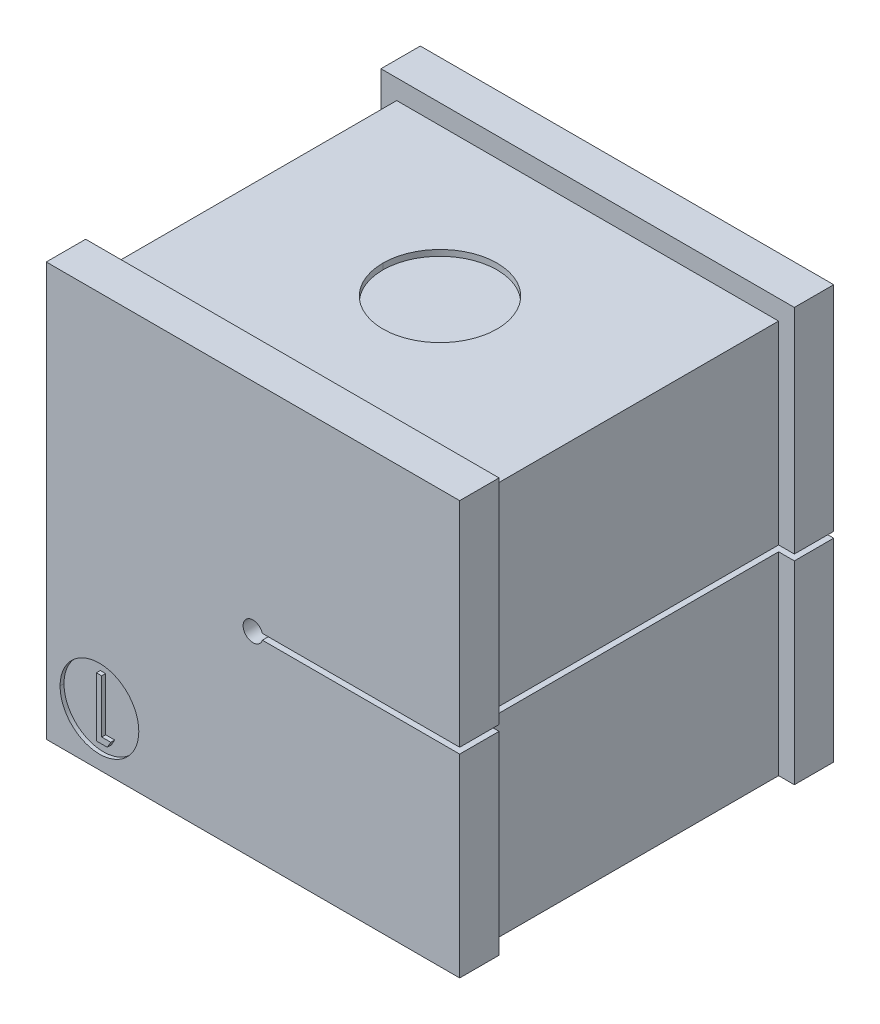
ISO-10303-21;
HEADER;
FILE_DESCRIPTION(('STEP AP214'),'2;1');
FILE_NAME('part.step','',(''),(''),'','','');
FILE_SCHEMA(('AUTOMOTIVE_DESIGN { 1 0 10303 214 1 1 1 1 }'));
ENDSEC;
DATA;
#1=APPLICATION_CONTEXT('core data for automotive mechanical design processes');
#2=APPLICATION_PROTOCOL_DEFINITION('international standard','automotive_design',2000,#1);
#3=PRODUCT_CONTEXT('',#1,'mechanical');
#4=PRODUCT('Part','Part','',(#3));
#5=PRODUCT_RELATED_PRODUCT_CATEGORY('part','',(#4));
#6=PRODUCT_DEFINITION_FORMATION('','',#4);
#7=PRODUCT_DEFINITION_CONTEXT('part definition',#1,'design');
#8=PRODUCT_DEFINITION('design','',#6,#7);
#9=PRODUCT_DEFINITION_SHAPE('','',#8);
#10=(LENGTH_UNIT() NAMED_UNIT(*) SI_UNIT(.MILLI.,.METRE.));
#11=(NAMED_UNIT(*) PLANE_ANGLE_UNIT() SI_UNIT($,.RADIAN.));
#12=(NAMED_UNIT(*) SI_UNIT($,.STERADIAN.) SOLID_ANGLE_UNIT());
#13=UNCERTAINTY_MEASURE_WITH_UNIT(LENGTH_MEASURE(1.E-05),#10,'distance_accuracy_value','');
#14=(GEOMETRIC_REPRESENTATION_CONTEXT(3) GLOBAL_UNCERTAINTY_ASSIGNED_CONTEXT((#13)) GLOBAL_UNIT_ASSIGNED_CONTEXT((#10,
#11,#12)) REPRESENTATION_CONTEXT('',''));
#15=CARTESIAN_POINT('',(0.,0.,0.));
#16=DIRECTION('',(0.,0.,1.));
#17=DIRECTION('',(1.,0.,0.));
#18=AXIS2_PLACEMENT_3D('',#15,#16,#17);
#19=CARTESIAN_POINT('',(0.,0.,9.5));
#20=DIRECTION('',(0.,0.,-1.));
#21=DIRECTION('',(0.,-1.,0.));
#22=AXIS2_PLACEMENT_3D('',#19,#20,#21);
#23=PLANE('',#22);
#24=DIRECTION('',(-0.496686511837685,-0.867930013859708,0.));
#25=VECTOR('',#24,1.);
#26=CARTESIAN_POINT('',(3.27692307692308,-8.99230769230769,9.5));
#27=LINE('',#26,#25);
#28=CARTESIAN_POINT('',(3.27692307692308,-8.99230769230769,9.5));
#29=VERTEX_POINT('',#28);
#30=CARTESIAN_POINT('',(3.10084134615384,-9.3,9.5));
#31=VERTEX_POINT('',#30);
#32=EDGE_CURVE('E585',#29,#31,#27,.T.);
#33=ORIENTED_EDGE('',*,*,#32,.F.);
#34=DIRECTION('',(1.,0.,0.));
#35=VECTOR('',#34,1.);
#36=CARTESIAN_POINT('',(2.81538461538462,-8.99230769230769,9.5));
#37=LINE('',#36,#35);
#38=CARTESIAN_POINT('',(2.81538461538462,-8.99230769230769,9.5));
#39=VERTEX_POINT('',#38);
#40=EDGE_CURVE('E536',#39,#29,#37,.T.);
#41=ORIENTED_EDGE('',*,*,#40,.F.);
#42=DIRECTION('',(0.,-1.,0.));
#43=VECTOR('',#42,1.);
#44=CARTESIAN_POINT('',(2.81538461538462,-6.3,9.5));
#45=LINE('',#44,#43);
#46=CARTESIAN_POINT('',(2.81538461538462,-6.3,9.5));
#47=VERTEX_POINT('',#46);
#48=EDGE_CURVE('E593',#47,#39,#45,.T.);
#49=ORIENTED_EDGE('',*,*,#48,.F.);
#50=DIRECTION('',(1.,0.,0.));
#51=VECTOR('',#50,1.);
#52=CARTESIAN_POINT('',(2.54615384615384,-6.3,9.5));
#53=LINE('',#52,#51);
#54=CARTESIAN_POINT('',(2.54615384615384,-6.3,9.5));
#55=VERTEX_POINT('',#54);
#56=EDGE_CURVE('E19',#55,#47,#53,.T.);
#57=ORIENTED_EDGE('',*,*,#56,.F.);
#58=DIRECTION('',(0.,1.,0.));
#59=VECTOR('',#58,1.);
#60=CARTESIAN_POINT('',(2.54615384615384,-9.3,9.5));
#61=LINE('',#60,#59);
#62=CARTESIAN_POINT('',(2.54615384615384,-9.3,9.5));
#63=VERTEX_POINT('',#62);
#64=EDGE_CURVE('E25',#63,#55,#61,.T.);
#65=ORIENTED_EDGE('',*,*,#64,.F.);
#66=DIRECTION('',(-1.,0.,0.));
#67=VECTOR('',#66,1.);
#68=CARTESIAN_POINT('',(3.10084134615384,-9.3,9.5));
#69=LINE('',#68,#67);
#70=EDGE_CURVE('E9',#31,#63,#69,.T.);
#71=ORIENTED_EDGE('',*,*,#70,.F.);
#72=EDGE_LOOP('',(#33,#41,#49,#57,#65,#71));
#73=FACE_BOUND('',#72,.T.);
#74=ADVANCED_FACE('F15',(#73),#23,.F.);
#75=CARTESIAN_POINT('',(3.10084134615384,-9.3,9.5));
#76=DIRECTION('',(0.,-1.,0.));
#77=DIRECTION('',(0.,0.,-1.));
#78=AXIS2_PLACEMENT_3D('',#75,#76,#77);
#79=PLANE('',#78);
#80=DIRECTION('',(-1.,0.,0.));
#81=VECTOR('',#80,1.);
#82=CARTESIAN_POINT('',(3.10084134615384,-9.3,9.3));
#83=LINE('',#82,#81);
#84=CARTESIAN_POINT('',(3.10084134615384,-9.3,9.3));
#85=VERTEX_POINT('',#84);
#86=CARTESIAN_POINT('',(2.54615384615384,-9.3,9.3));
#87=VERTEX_POINT('',#86);
#88=EDGE_CURVE('E440',#85,#87,#83,.T.);
#89=ORIENTED_EDGE('',*,*,#88,.F.);
#90=DIRECTION('',(0.,0.,-1.));
#91=VECTOR('',#90,1.);
#92=CARTESIAN_POINT('',(3.10084134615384,-9.3,9.5));
#93=LINE('',#92,#91);
#94=EDGE_CURVE('E537',#31,#85,#93,.T.);
#95=ORIENTED_EDGE('',*,*,#94,.F.);
#96=ORIENTED_EDGE('',*,*,#70,.T.);
#97=DIRECTION('',(0.,0.,-1.));
#98=VECTOR('',#97,1.);
#99=CARTESIAN_POINT('',(2.54615384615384,-9.3,9.5));
#100=LINE('',#99,#98);
#101=EDGE_CURVE('E349',#63,#87,#100,.T.);
#102=ORIENTED_EDGE('',*,*,#101,.T.);
#103=EDGE_LOOP('',(#89,#95,#96,#102));
#104=FACE_BOUND('',#103,.T.);
#105=ADVANCED_FACE('F616',(#104),#79,.T.);
#106=CARTESIAN_POINT('',(2.54615384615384,-9.3,9.5));
#107=DIRECTION('',(-1.,0.,0.));
#108=DIRECTION('',(0.,0.,1.));
#109=AXIS2_PLACEMENT_3D('',#106,#107,#108);
#110=PLANE('',#109);
#111=DIRECTION('',(0.,1.,0.));
#112=VECTOR('',#111,1.);
#113=CARTESIAN_POINT('',(2.54615384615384,-9.3,9.3));
#114=LINE('',#113,#112);
#115=CARTESIAN_POINT('',(2.54615384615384,-6.3,9.3));
#116=VERTEX_POINT('',#115);
#117=EDGE_CURVE('E444',#87,#116,#114,.T.);
#118=ORIENTED_EDGE('',*,*,#117,.F.);
#119=ORIENTED_EDGE('',*,*,#101,.F.);
#120=ORIENTED_EDGE('',*,*,#64,.T.);
#121=DIRECTION('',(0.,0.,-1.));
#122=VECTOR('',#121,1.);
#123=CARTESIAN_POINT('',(2.54615384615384,-6.3,9.5));
#124=LINE('',#123,#122);
#125=EDGE_CURVE('E595',#55,#116,#124,.T.);
#126=ORIENTED_EDGE('',*,*,#125,.T.);
#127=EDGE_LOOP('',(#118,#119,#120,#126));
#128=FACE_BOUND('',#127,.T.);
#129=ADVANCED_FACE('F17',(#128),#110,.T.);
#130=CARTESIAN_POINT('',(2.54615384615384,-6.3,9.5));
#131=DIRECTION('',(0.,1.,0.));
#132=DIRECTION('',(1.,0.,0.));
#133=AXIS2_PLACEMENT_3D('',#130,#131,#132);
#134=PLANE('',#133);
#135=DIRECTION('',(1.,0.,0.));
#136=VECTOR('',#135,1.);
#137=CARTESIAN_POINT('',(2.54615384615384,-6.3,9.3));
#138=LINE('',#137,#136);
#139=CARTESIAN_POINT('',(2.81538461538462,-6.3,9.3));
#140=VERTEX_POINT('',#139);
#141=EDGE_CURVE('E576',#116,#140,#138,.T.);
#142=ORIENTED_EDGE('',*,*,#141,.F.);
#143=ORIENTED_EDGE('',*,*,#125,.F.);
#144=ORIENTED_EDGE('',*,*,#56,.T.);
#145=DIRECTION('',(0.,0.,-1.));
#146=VECTOR('',#145,1.);
#147=CARTESIAN_POINT('',(2.81538461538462,-6.3,9.5));
#148=LINE('',#147,#146);
#149=EDGE_CURVE('E544',#47,#140,#148,.T.);
#150=ORIENTED_EDGE('',*,*,#149,.T.);
#151=EDGE_LOOP('',(#142,#143,#144,#150));
#152=FACE_BOUND('',#151,.T.);
#153=ADVANCED_FACE('F604',(#152),#134,.T.);
#154=CARTESIAN_POINT('',(2.81538461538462,-6.3,9.5));
#155=DIRECTION('',(1.,0.,0.));
#156=DIRECTION('',(0.,1.,0.));
#157=AXIS2_PLACEMENT_3D('',#154,#155,#156);
#158=PLANE('',#157);
#159=DIRECTION('',(0.,-1.,0.));
#160=VECTOR('',#159,1.);
#161=CARTESIAN_POINT('',(2.81538461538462,-6.3,9.3));
#162=LINE('',#161,#160);
#163=CARTESIAN_POINT('',(2.81538461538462,-8.99230769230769,9.3));
#164=VERTEX_POINT('',#163);
#165=EDGE_CURVE('E514',#140,#164,#162,.T.);
#166=ORIENTED_EDGE('',*,*,#165,.F.);
#167=ORIENTED_EDGE('',*,*,#149,.F.);
#168=ORIENTED_EDGE('',*,*,#48,.T.);
#169=DIRECTION('',(0.,0.,-1.));
#170=VECTOR('',#169,1.);
#171=CARTESIAN_POINT('',(2.81538461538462,-8.99230769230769,9.5));
#172=LINE('',#171,#170);
#173=EDGE_CURVE('E533',#39,#164,#172,.T.);
#174=ORIENTED_EDGE('',*,*,#173,.T.);
#175=EDGE_LOOP('',(#166,#167,#168,#174));
#176=FACE_BOUND('',#175,.T.);
#177=ADVANCED_FACE('F612',(#176),#158,.T.);
#178=CARTESIAN_POINT('',(2.81538461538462,-8.99230769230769,9.5));
#179=DIRECTION('',(0.,1.,0.));
#180=DIRECTION('',(1.,0.,0.));
#181=AXIS2_PLACEMENT_3D('',#178,#179,#180);
#182=PLANE('',#181);
#183=DIRECTION('',(1.,0.,0.));
#184=VECTOR('',#183,1.);
#185=CARTESIAN_POINT('',(2.81538461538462,-8.99230769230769,9.3));
#186=LINE('',#185,#184);
#187=CARTESIAN_POINT('',(3.27692307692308,-8.99230769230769,9.3));
#188=VERTEX_POINT('',#187);
#189=EDGE_CURVE('E509',#164,#188,#186,.T.);
#190=ORIENTED_EDGE('',*,*,#189,.F.);
#191=ORIENTED_EDGE('',*,*,#173,.F.);
#192=ORIENTED_EDGE('',*,*,#40,.T.);
#193=DIRECTION('',(0.,0.,-1.));
#194=VECTOR('',#193,1.);
#195=CARTESIAN_POINT('',(3.27692307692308,-8.99230769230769,9.5));
#196=LINE('',#195,#194);
#197=EDGE_CURVE('E513',#29,#188,#196,.T.);
#198=ORIENTED_EDGE('',*,*,#197,.T.);
#199=EDGE_LOOP('',(#190,#191,#192,#198));
#200=FACE_BOUND('',#199,.T.);
#201=ADVANCED_FACE('F622',(#200),#182,.T.);
#202=CARTESIAN_POINT('',(3.27692307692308,-8.99230769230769,9.5));
#203=DIRECTION('',(0.867930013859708,-0.496686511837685,0.));
#204=DIRECTION('',(0.,0.,-1.));
#205=AXIS2_PLACEMENT_3D('',#202,#203,#204);
#206=PLANE('',#205);
#207=DIRECTION('',(-0.496686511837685,-0.867930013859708,0.));
#208=VECTOR('',#207,1.);
#209=CARTESIAN_POINT('',(3.27692307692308,-8.99230769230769,9.3));
#210=LINE('',#209,#208);
#211=EDGE_CURVE('E281',#188,#85,#210,.T.);
#212=ORIENTED_EDGE('',*,*,#211,.F.);
#213=ORIENTED_EDGE('',*,*,#197,.F.);
#214=ORIENTED_EDGE('',*,*,#32,.T.);
#215=ORIENTED_EDGE('',*,*,#94,.T.);
#216=EDGE_LOOP('',(#212,#213,#214,#215));
#217=FACE_BOUND('',#216,.T.);
#218=ADVANCED_FACE('F620',(#217),#206,.T.);
#219=CARTESIAN_POINT('',(10.5,-0.5,-10.9142135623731));
#220=DIRECTION('',(0.,0.,1.));
#221=DIRECTION('',(1.,0.,0.));
#222=AXIS2_PLACEMENT_3D('',#219,#220,#221);
#223=CYLINDRICAL_SURFACE('',#222,0.5);
#224=DIRECTION('',(0.,0.,1.));
#225=VECTOR('',#224,1.);
#226=CARTESIAN_POINT('',(10.9769696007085,-0.35,-10.9142135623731));
#227=LINE('',#226,#225);
#228=CARTESIAN_POINT('',(10.9769696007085,-0.35,-9.5));
#229=VERTEX_POINT('',#228);
#230=CARTESIAN_POINT('',(10.9769696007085,-0.35,9.5));
#231=VERTEX_POINT('',#230);
#232=EDGE_CURVE('E393',#229,#231,#227,.T.);
#233=ORIENTED_EDGE('',*,*,#232,.T.);
#234=CARTESIAN_POINT('',(10.5,-0.5,9.5));
#235=DIRECTION('',(0.,0.,1.));
#236=DIRECTION('',(1.,0.,0.));
#237=AXIS2_PLACEMENT_3D('',#234,#235,#236);
#238=CIRCLE('',#237,0.5);
#239=CARTESIAN_POINT('',(10.9769696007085,-0.65,9.5));
#240=VERTEX_POINT('',#239);
#241=EDGE_CURVE('E478',#231,#240,#238,.T.);
#242=ORIENTED_EDGE('',*,*,#241,.T.);
#243=DIRECTION('',(0.,0.,-1.));
#244=VECTOR('',#243,1.);
#245=CARTESIAN_POINT('',(10.9769696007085,-0.65,-10.9142135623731));
#246=LINE('',#245,#244);
#247=CARTESIAN_POINT('',(10.9769696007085,-0.65,-9.5));
#248=VERTEX_POINT('',#247);
#249=EDGE_CURVE('E320',#240,#248,#246,.T.);
#250=ORIENTED_EDGE('',*,*,#249,.T.);
#251=CARTESIAN_POINT('',(10.5,-0.5,-9.5));
#252=DIRECTION('',(0.,0.,1.));
#253=DIRECTION('',(-1.,0.,0.));
#254=AXIS2_PLACEMENT_3D('',#251,#252,#253);
#255=CIRCLE('',#254,0.5);
#256=EDGE_CURVE('E477',#229,#248,#255,.T.);
#257=ORIENTED_EDGE('',*,*,#256,.F.);
#258=EDGE_LOOP('',(#233,#242,#250,#257));
#259=FACE_BOUND('',#258,.T.);
#260=ADVANCED_FACE('F630',(#259),#223,.F.);
#261=CARTESIAN_POINT('',(2.7,-7.8,9.3));
#262=DIRECTION('',(0.,0.,1.));
#263=DIRECTION('',(1.,0.,0.));
#264=AXIS2_PLACEMENT_3D('',#261,#262,#263);
#265=PLANE('',#264);
#266=ORIENTED_EDGE('',*,*,#211,.T.);
#267=ORIENTED_EDGE('',*,*,#88,.T.);
#268=ORIENTED_EDGE('',*,*,#117,.T.);
#269=ORIENTED_EDGE('',*,*,#141,.T.);
#270=ORIENTED_EDGE('',*,*,#165,.T.);
#271=ORIENTED_EDGE('',*,*,#189,.T.);
#272=EDGE_LOOP('',(#266,#267,#268,#269,#270,#271));
#273=FACE_BOUND('',#272,.T.);
#274=CARTESIAN_POINT('',(2.7,-7.8,9.3));
#275=DIRECTION('',(0.,0.,1.));
#276=DIRECTION('',(1.,0.,0.));
#277=AXIS2_PLACEMENT_3D('',#274,#275,#276);
#278=CIRCLE('',#277,2.);
#279=CARTESIAN_POINT('',(4.7,-7.8,9.3));
#280=VERTEX_POINT('',#279);
#281=CARTESIAN_POINT('',(0.7,-7.8,9.3));
#282=VERTEX_POINT('',#281);
#283=EDGE_CURVE('E272',#280,#282,#278,.T.);
#284=ORIENTED_EDGE('',*,*,#283,.T.);
#285=CARTESIAN_POINT('',(2.7,-7.8,9.3));
#286=DIRECTION('',(0.,0.,1.));
#287=DIRECTION('',(1.,0.,0.));
#288=AXIS2_PLACEMENT_3D('',#285,#286,#287);
#289=CIRCLE('',#288,2.);
#290=EDGE_CURVE('E276',#282,#280,#289,.T.);
#291=ORIENTED_EDGE('',*,*,#290,.T.);
#292=EDGE_LOOP('',(#284,#291));
#293=FACE_BOUND('',#292,.T.);
#294=ADVANCED_FACE('F274',(#273,#293),#265,.T.);
#295=CARTESIAN_POINT('',(2.7,-7.8,9.3));
#296=DIRECTION('',(0.,0.,1.));
#297=DIRECTION('',(1.,0.,0.));
#298=AXIS2_PLACEMENT_3D('',#295,#296,#297);
#299=CYLINDRICAL_SURFACE('',#298,2.);
#300=DIRECTION('',(0.,0.,1.));
#301=VECTOR('',#300,1.);
#302=CARTESIAN_POINT('',(0.7,-7.8,9.3));
#303=LINE('',#302,#301);
#304=CARTESIAN_POINT('',(0.7,-7.8,9.5));
#305=VERTEX_POINT('',#304);
#306=EDGE_CURVE('E285',#282,#305,#303,.T.);
#307=ORIENTED_EDGE('',*,*,#306,.F.);
#308=ORIENTED_EDGE('',*,*,#283,.F.);
#309=DIRECTION('',(0.,0.,1.));
#310=VECTOR('',#309,1.);
#311=CARTESIAN_POINT('',(4.7,-7.8,9.3));
#312=LINE('',#311,#310);
#313=CARTESIAN_POINT('',(4.7,-7.8,9.5));
#314=VERTEX_POINT('',#313);
#315=EDGE_CURVE('E295',#280,#314,#312,.T.);
#316=ORIENTED_EDGE('',*,*,#315,.T.);
#317=CARTESIAN_POINT('',(2.7,-7.8,9.5));
#318=DIRECTION('',(0.,0.,1.));
#319=DIRECTION('',(1.,0.,0.));
#320=AXIS2_PLACEMENT_3D('',#317,#318,#319);
#321=CIRCLE('',#320,2.);
#322=EDGE_CURVE('E287',#314,#305,#321,.T.);
#323=ORIENTED_EDGE('',*,*,#322,.T.);
#324=EDGE_LOOP('',(#307,#308,#316,#323));
#325=FACE_BOUND('',#324,.T.);
#326=ADVANCED_FACE('F286',(#325),#299,.F.);
#327=CARTESIAN_POINT('',(10.5,9.2,0.));
#328=DIRECTION('',(0.,1.,0.));
#329=DIRECTION('',(-1.,0.,0.));
#330=AXIS2_PLACEMENT_3D('',#327,#328,#329);
#331=CYLINDRICAL_SURFACE('',#330,2.9);
#332=DIRECTION('',(0.,1.,0.));
#333=VECTOR('',#332,1.);
#334=CARTESIAN_POINT('',(13.4,9.2,0.));
#335=LINE('',#334,#333);
#336=CARTESIAN_POINT('',(13.4,9.2,0.));
#337=VERTEX_POINT('',#336);
#338=CARTESIAN_POINT('',(13.4,9.5,0.));
#339=VERTEX_POINT('',#338);
#340=EDGE_CURVE('E355',#337,#339,#335,.T.);
#341=ORIENTED_EDGE('',*,*,#340,.F.);
#342=CARTESIAN_POINT('',(10.5,9.2,0.));
#343=DIRECTION('',(0.,1.,0.));
#344=DIRECTION('',(-1.,0.,0.));
#345=AXIS2_PLACEMENT_3D('',#342,#343,#344);
#346=CIRCLE('',#345,2.9);
#347=CARTESIAN_POINT('',(7.6,9.2,0.));
#348=VERTEX_POINT('',#347);
#349=EDGE_CURVE('E282',#348,#337,#346,.T.);
#350=ORIENTED_EDGE('',*,*,#349,.F.);
#351=DIRECTION('',(0.,1.,0.));
#352=VECTOR('',#351,1.);
#353=CARTESIAN_POINT('',(7.6,9.2,0.));
#354=LINE('',#353,#352);
#355=CARTESIAN_POINT('',(7.6,9.5,0.));
#356=VERTEX_POINT('',#355);
#357=EDGE_CURVE('E373',#348,#356,#354,.T.);
#358=ORIENTED_EDGE('',*,*,#357,.T.);
#359=CARTESIAN_POINT('',(10.5,9.5,0.));
#360=DIRECTION('',(0.,-1.,0.));
#361=DIRECTION('',(1.,0.,0.));
#362=AXIS2_PLACEMENT_3D('',#359,#360,#361);
#363=CIRCLE('',#362,2.9);
#364=EDGE_CURVE('E490',#339,#356,#363,.T.);
#365=ORIENTED_EDGE('',*,*,#364,.F.);
#366=EDGE_LOOP('',(#341,#350,#358,#365));
#367=FACE_BOUND('',#366,.T.);
#368=ADVANCED_FACE('F680',(#367),#331,.F.);
#369=CARTESIAN_POINT('',(10.5,9.2,0.));
#370=DIRECTION('',(0.,1.,0.));
#371=DIRECTION('',(1.,0.,0.));
#372=AXIS2_PLACEMENT_3D('',#369,#370,#371);
#373=PLANE('',#372);
#374=ORIENTED_EDGE('',*,*,#349,.T.);
#375=CARTESIAN_POINT('',(10.5,9.2,0.));
#376=DIRECTION('',(0.,1.,0.));
#377=DIRECTION('',(-1.,0.,0.));
#378=AXIS2_PLACEMENT_3D('',#375,#376,#377);
#379=CIRCLE('',#378,2.9);
#380=EDGE_CURVE('E348',#337,#348,#379,.T.);
#381=ORIENTED_EDGE('',*,*,#380,.T.);
#382=EDGE_LOOP('',(#374,#381));
#383=FACE_BOUND('',#382,.T.);
#384=ADVANCED_FACE('F726',(#383),#373,.T.);
#385=CARTESIAN_POINT('',(1.3,0.,7.5));
#386=DIRECTION('',(0.,0.,1.));
#387=DIRECTION('',(1.,0.,0.));
#388=AXIS2_PLACEMENT_3D('',#385,#386,#387);
#389=PLANE('',#388);
#390=DIRECTION('',(0.,-1.,0.));
#391=VECTOR('',#390,1.);
#392=CARTESIAN_POINT('',(20.2,9.5,7.5));
#393=LINE('',#392,#391);
#394=CARTESIAN_POINT('',(20.2,-0.65,7.5));
#395=VERTEX_POINT('',#394);
#396=CARTESIAN_POINT('',(20.2,-10.5,7.5));
#397=VERTEX_POINT('',#396);
#398=EDGE_CURVE('E508',#395,#397,#393,.T.);
#399=ORIENTED_EDGE('',*,*,#398,.F.);
#400=DIRECTION('',(1.,0.,0.));
#401=VECTOR('',#400,1.);
#402=CARTESIAN_POINT('',(1.3,-0.65,7.5));
#403=LINE('',#402,#401);
#404=CARTESIAN_POINT('',(21.,-0.65,7.5));
#405=VERTEX_POINT('',#404);
#406=EDGE_CURVE('E300',#395,#405,#403,.T.);
#407=ORIENTED_EDGE('',*,*,#406,.T.);
#408=DIRECTION('',(0.,1.,0.));
#409=VECTOR('',#408,1.);
#410=CARTESIAN_POINT('',(21.,-10.5,7.5));
#411=LINE('',#410,#409);
#412=CARTESIAN_POINT('',(21.,-10.5,7.5));
#413=VERTEX_POINT('',#412);
#414=EDGE_CURVE('E307',#413,#405,#411,.T.);
#415=ORIENTED_EDGE('',*,*,#414,.F.);
#416=DIRECTION('',(-1.,0.,0.));
#417=VECTOR('',#416,1.);
#418=CARTESIAN_POINT('',(19.7,-10.5,7.5));
#419=LINE('',#418,#417);
#420=EDGE_CURVE('E449',#413,#397,#419,.T.);
#421=ORIENTED_EDGE('',*,*,#420,.T.);
#422=EDGE_LOOP('',(#399,#407,#415,#421));
#423=FACE_BOUND('',#422,.T.);
#424=ADVANCED_FACE('F722',(#423),#389,.F.);
#425=CARTESIAN_POINT('',(0.,0.,-7.5));
#426=DIRECTION('',(0.,0.,-1.));
#427=DIRECTION('',(-1.,0.,0.));
#428=AXIS2_PLACEMENT_3D('',#425,#426,#427);
#429=PLANE('',#428);
#430=DIRECTION('',(0.,1.,0.));
#431=VECTOR('',#430,1.);
#432=CARTESIAN_POINT('',(21.,-10.5,-7.5));
#433=LINE('',#432,#431);
#434=CARTESIAN_POINT('',(21.,-10.5,-7.5));
#435=VERTEX_POINT('',#434);
#436=CARTESIAN_POINT('',(21.,-0.65,-7.5));
#437=VERTEX_POINT('',#436);
#438=EDGE_CURVE('E328',#435,#437,#433,.T.);
#439=ORIENTED_EDGE('',*,*,#438,.T.);
#440=DIRECTION('',(-1.,0.,0.));
#441=VECTOR('',#440,1.);
#442=CARTESIAN_POINT('',(0.,-0.65,-7.5));
#443=LINE('',#442,#441);
#444=CARTESIAN_POINT('',(20.2,-0.65,-7.5));
#445=VERTEX_POINT('',#444);
#446=EDGE_CURVE('E313',#437,#445,#443,.T.);
#447=ORIENTED_EDGE('',*,*,#446,.T.);
#448=DIRECTION('',(0.,1.,0.));
#449=VECTOR('',#448,1.);
#450=CARTESIAN_POINT('',(20.2,9.5,-7.5));
#451=LINE('',#450,#449);
#452=CARTESIAN_POINT('',(20.2,-10.5,-7.5));
#453=VERTEX_POINT('',#452);
#454=EDGE_CURVE('E522',#453,#445,#451,.T.);
#455=ORIENTED_EDGE('',*,*,#454,.F.);
#456=DIRECTION('',(1.,0.,0.));
#457=VECTOR('',#456,1.);
#458=CARTESIAN_POINT('',(21.,-10.5,-7.5));
#459=LINE('',#458,#457);
#460=EDGE_CURVE('E453',#453,#435,#459,.T.);
#461=ORIENTED_EDGE('',*,*,#460,.T.);
#462=EDGE_LOOP('',(#439,#447,#455,#461));
#463=FACE_BOUND('',#462,.T.);
#464=ADVANCED_FACE('F718',(#463),#429,.F.);
#465=CARTESIAN_POINT('',(0.,0.,-9.5));
#466=DIRECTION('',(0.,0.,-1.));
#467=DIRECTION('',(0.,-1.,0.));
#468=AXIS2_PLACEMENT_3D('',#465,#466,#467);
#469=PLANE('',#468);
#470=DIRECTION('',(-1.,0.,0.));
#471=VECTOR('',#470,1.);
#472=CARTESIAN_POINT('',(10.0230303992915,-0.35,-9.5));
#473=LINE('',#472,#471);
#474=CARTESIAN_POINT('',(21.,-0.35,-9.5));
#475=VERTEX_POINT('',#474);
#476=EDGE_CURVE('E397',#475,#229,#473,.T.);
#477=ORIENTED_EDGE('',*,*,#476,.T.);
#478=ORIENTED_EDGE('',*,*,#256,.T.);
#479=DIRECTION('',(1.,0.,0.));
#480=VECTOR('',#479,1.);
#481=CARTESIAN_POINT('',(10.0230303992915,-0.65,-9.5));
#482=LINE('',#481,#480);
#483=CARTESIAN_POINT('',(21.,-0.65,-9.5));
#484=VERTEX_POINT('',#483);
#485=EDGE_CURVE('E325',#248,#484,#482,.T.);
#486=ORIENTED_EDGE('',*,*,#485,.T.);
#487=DIRECTION('',(0.,-1.,0.));
#488=VECTOR('',#487,1.);
#489=CARTESIAN_POINT('',(21.,0.,-9.5));
#490=LINE('',#489,#488);
#491=CARTESIAN_POINT('',(21.,-10.5,-9.5));
#492=VERTEX_POINT('',#491);
#493=EDGE_CURVE('E308',#484,#492,#490,.T.);
#494=ORIENTED_EDGE('',*,*,#493,.T.);
#495=DIRECTION('',(-1.,0.,0.));
#496=VECTOR('',#495,1.);
#497=CARTESIAN_POINT('',(0.,-10.5,-9.5));
#498=LINE('',#497,#496);
#499=CARTESIAN_POINT('',(0.,-10.5,-9.5));
#500=VERTEX_POINT('',#499);
#501=EDGE_CURVE('E532',#492,#500,#498,.T.);
#502=ORIENTED_EDGE('',*,*,#501,.T.);
#503=DIRECTION('',(0.,-1.,0.));
#504=VECTOR('',#503,1.);
#505=CARTESIAN_POINT('',(0.,0.,-9.5));
#506=LINE('',#505,#504);
#507=CARTESIAN_POINT('',(0.,10.5,-9.5));
#508=VERTEX_POINT('',#507);
#509=EDGE_CURVE('E345',#508,#500,#506,.T.);
#510=ORIENTED_EDGE('',*,*,#509,.F.);
#511=DIRECTION('',(-1.,0.,0.));
#512=VECTOR('',#511,1.);
#513=CARTESIAN_POINT('',(0.,10.5,-9.5));
#514=LINE('',#513,#512);
#515=CARTESIAN_POINT('',(21.,10.5,-9.5));
#516=VERTEX_POINT('',#515);
#517=EDGE_CURVE('E500',#516,#508,#514,.T.);
#518=ORIENTED_EDGE('',*,*,#517,.F.);
#519=DIRECTION('',(0.,-1.,0.));
#520=VECTOR('',#519,1.);
#521=CARTESIAN_POINT('',(21.,0.,-9.5));
#522=LINE('',#521,#520);
#523=EDGE_CURVE('E432',#516,#475,#522,.T.);
#524=ORIENTED_EDGE('',*,*,#523,.T.);
#525=EDGE_LOOP('',(#477,#478,#486,#494,#502,#510,#518,#524));
#526=FACE_BOUND('',#525,.T.);
#527=ADVANCED_FACE('F714',(#526),#469,.T.);
#528=CARTESIAN_POINT('',(0.,0.,9.5));
#529=DIRECTION('',(0.,0.,-1.));
#530=DIRECTION('',(0.,-1.,0.));
#531=AXIS2_PLACEMENT_3D('',#528,#529,#530);
#532=PLANE('',#531);
#533=ORIENTED_EDGE('',*,*,#322,.F.);
#534=CARTESIAN_POINT('',(2.7,-7.8,9.5));
#535=DIRECTION('',(0.,0.,1.));
#536=DIRECTION('',(1.,0.,0.));
#537=AXIS2_PLACEMENT_3D('',#534,#535,#536);
#538=CIRCLE('',#537,2.);
#539=EDGE_CURVE('E292',#305,#314,#538,.T.);
#540=ORIENTED_EDGE('',*,*,#539,.F.);
#541=EDGE_LOOP('',(#533,#540));
#542=FACE_BOUND('',#541,.T.);
#543=ORIENTED_EDGE('',*,*,#241,.F.);
#544=DIRECTION('',(-1.,0.,0.));
#545=VECTOR('',#544,1.);
#546=CARTESIAN_POINT('',(10.0230303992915,-0.35,9.5));
#547=LINE('',#546,#545);
#548=CARTESIAN_POINT('',(21.,-0.35,9.5));
#549=VERTEX_POINT('',#548);
#550=EDGE_CURVE('E386',#549,#231,#547,.T.);
#551=ORIENTED_EDGE('',*,*,#550,.F.);
#552=DIRECTION('',(0.,-1.,0.));
#553=VECTOR('',#552,1.);
#554=CARTESIAN_POINT('',(21.,0.,9.5));
#555=LINE('',#554,#553);
#556=CARTESIAN_POINT('',(21.,10.5,9.5));
#557=VERTEX_POINT('',#556);
#558=EDGE_CURVE('E465',#557,#549,#555,.T.);
#559=ORIENTED_EDGE('',*,*,#558,.F.);
#560=DIRECTION('',(-1.,0.,0.));
#561=VECTOR('',#560,1.);
#562=CARTESIAN_POINT('',(0.,10.5,9.5));
#563=LINE('',#562,#561);
#564=CARTESIAN_POINT('',(0.,10.5,9.5));
#565=VERTEX_POINT('',#564);
#566=EDGE_CURVE('E496',#557,#565,#563,.T.);
#567=ORIENTED_EDGE('',*,*,#566,.T.);
#568=DIRECTION('',(0.,-1.,0.));
#569=VECTOR('',#568,1.);
#570=CARTESIAN_POINT('',(0.,0.,9.5));
#571=LINE('',#570,#569);
#572=CARTESIAN_POINT('',(0.,-10.5,9.5));
#573=VERTEX_POINT('',#572);
#574=EDGE_CURVE('E342',#565,#573,#571,.T.);
#575=ORIENTED_EDGE('',*,*,#574,.T.);
#576=DIRECTION('',(-1.,0.,0.));
#577=VECTOR('',#576,1.);
#578=CARTESIAN_POINT('',(0.,-10.5,9.5));
#579=LINE('',#578,#577);
#580=CARTESIAN_POINT('',(21.,-10.5,9.5));
#581=VERTEX_POINT('',#580);
#582=EDGE_CURVE('E554',#581,#573,#579,.T.);
#583=ORIENTED_EDGE('',*,*,#582,.F.);
#584=DIRECTION('',(0.,-1.,0.));
#585=VECTOR('',#584,1.);
#586=CARTESIAN_POINT('',(21.,0.,9.5));
#587=LINE('',#586,#585);
#588=CARTESIAN_POINT('',(21.,-0.65,9.5));
#589=VERTEX_POINT('',#588);
#590=EDGE_CURVE('E305',#589,#581,#587,.T.);
#591=ORIENTED_EDGE('',*,*,#590,.F.);
#592=DIRECTION('',(1.,0.,0.));
#593=VECTOR('',#592,1.);
#594=CARTESIAN_POINT('',(10.0230303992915,-0.65,9.5));
#595=LINE('',#594,#593);
#596=EDGE_CURVE('E324',#240,#589,#595,.T.);
#597=ORIENTED_EDGE('',*,*,#596,.F.);
#598=EDGE_LOOP('',(#543,#551,#559,#567,#575,#583,#591,#597));
#599=FACE_BOUND('',#598,.T.);
#600=ADVANCED_FACE('F710',(#542,#599),#532,.F.);
#601=CARTESIAN_POINT('',(0.8,0.,1.75));
#602=DIRECTION('',(1.,0.,0.));
#603=DIRECTION('',(0.,0.,-1.));
#604=AXIS2_PLACEMENT_3D('',#601,#602,#603);
#605=PLANE('',#604);
#606=DIRECTION('',(0.,0.,-1.));
#607=VECTOR('',#606,1.);
#608=CARTESIAN_POINT('',(0.8,-10.5,1.75));
#609=LINE('',#608,#607);
#610=CARTESIAN_POINT('',(0.8,-10.5,7.5));
#611=VERTEX_POINT('',#610);
#612=CARTESIAN_POINT('',(0.8,-10.5,-7.5));
#613=VERTEX_POINT('',#612);
#614=EDGE_CURVE('E525',#611,#613,#609,.T.);
#615=ORIENTED_EDGE('',*,*,#614,.F.);
#616=DIRECTION('',(0.,1.,0.));
#617=VECTOR('',#616,1.);
#618=CARTESIAN_POINT('',(0.8,9.5,7.5));
#619=LINE('',#618,#617);
#620=CARTESIAN_POINT('',(0.8,9.5,7.5));
#621=VERTEX_POINT('',#620);
#622=EDGE_CURVE('E481',#611,#621,#619,.T.);
#623=ORIENTED_EDGE('',*,*,#622,.T.);
#624=DIRECTION('',(0.,0.,-1.));
#625=VECTOR('',#624,1.);
#626=CARTESIAN_POINT('',(0.8,9.5,1.75));
#627=LINE('',#626,#625);
#628=CARTESIAN_POINT('',(0.8,9.5,-7.5));
#629=VERTEX_POINT('',#628);
#630=EDGE_CURVE('E338',#621,#629,#627,.T.);
#631=ORIENTED_EDGE('',*,*,#630,.T.);
#632=DIRECTION('',(0.,-1.,0.));
#633=VECTOR('',#632,1.);
#634=CARTESIAN_POINT('',(0.8,9.5,-7.5));
#635=LINE('',#634,#633);
#636=EDGE_CURVE('E360',#629,#613,#635,.T.);
#637=ORIENTED_EDGE('',*,*,#636,.T.);
#638=EDGE_LOOP('',(#615,#623,#631,#637));
#639=FACE_BOUND('',#638,.T.);
#640=ADVANCED_FACE('F706',(#639),#605,.F.);
#641=CARTESIAN_POINT('',(0.,0.,9.5));
#642=DIRECTION('',(1.,0.,0.));
#643=DIRECTION('',(0.,1.,0.));
#644=AXIS2_PLACEMENT_3D('',#641,#642,#643);
#645=PLANE('',#644);
#646=DIRECTION('',(0.,0.,-1.));
#647=VECTOR('',#646,1.);
#648=CARTESIAN_POINT('',(0.,-10.5,9.5));
#649=LINE('',#648,#647);
#650=CARTESIAN_POINT('',(0.,-10.5,-7.5));
#651=VERTEX_POINT('',#650);
#652=EDGE_CURVE('E528',#651,#500,#649,.T.);
#653=ORIENTED_EDGE('',*,*,#652,.F.);
#654=DIRECTION('',(0.,1.,0.));
#655=VECTOR('',#654,1.);
#656=CARTESIAN_POINT('',(0.,0.,-7.5));
#657=LINE('',#656,#655);
#658=CARTESIAN_POINT('',(0.,10.5,-7.5));
#659=VERTEX_POINT('',#658);
#660=EDGE_CURVE('E361',#651,#659,#657,.T.);
#661=ORIENTED_EDGE('',*,*,#660,.T.);
#662=DIRECTION('',(0.,0.,-1.));
#663=VECTOR('',#662,1.);
#664=CARTESIAN_POINT('',(0.,10.5,9.5));
#665=LINE('',#664,#663);
#666=EDGE_CURVE('E504',#659,#508,#665,.T.);
#667=ORIENTED_EDGE('',*,*,#666,.T.);
#668=ORIENTED_EDGE('',*,*,#509,.T.);
#669=EDGE_LOOP('',(#653,#661,#667,#668));
#670=FACE_BOUND('',#669,.T.);
#671=ADVANCED_FACE('F702',(#670),#645,.F.);
#672=CARTESIAN_POINT('',(0.,0.,9.5));
#673=DIRECTION('',(1.,0.,0.));
#674=DIRECTION('',(0.,1.,0.));
#675=AXIS2_PLACEMENT_3D('',#672,#673,#674);
#676=PLANE('',#675);
#677=DIRECTION('',(0.,1.,0.));
#678=VECTOR('',#677,1.);
#679=CARTESIAN_POINT('',(0.,0.,7.5));
#680=LINE('',#679,#678);
#681=CARTESIAN_POINT('',(0.,-10.5,7.5));
#682=VERTEX_POINT('',#681);
#683=CARTESIAN_POINT('',(0.,10.5,7.5));
#684=VERTEX_POINT('',#683);
#685=EDGE_CURVE('E314',#682,#684,#680,.T.);
#686=ORIENTED_EDGE('',*,*,#685,.F.);
#687=DIRECTION('',(0.,0.,-1.));
#688=VECTOR('',#687,1.);
#689=CARTESIAN_POINT('',(0.,-10.5,9.5));
#690=LINE('',#689,#688);
#691=EDGE_CURVE('E331',#573,#682,#690,.T.);
#692=ORIENTED_EDGE('',*,*,#691,.F.);
#693=ORIENTED_EDGE('',*,*,#574,.F.);
#694=DIRECTION('',(0.,0.,-1.));
#695=VECTOR('',#694,1.);
#696=CARTESIAN_POINT('',(0.,10.5,9.5));
#697=LINE('',#696,#695);
#698=EDGE_CURVE('E493',#565,#684,#697,.T.);
#699=ORIENTED_EDGE('',*,*,#698,.T.);
#700=EDGE_LOOP('',(#686,#692,#693,#699));
#701=FACE_BOUND('',#700,.T.);
#702=ADVANCED_FACE('F698',(#701),#676,.F.);
#703=CARTESIAN_POINT('',(21.,0.,9.5));
#704=DIRECTION('',(1.,0.,0.));
#705=DIRECTION('',(0.,1.,0.));
#706=AXIS2_PLACEMENT_3D('',#703,#704,#705);
#707=PLANE('',#706);
#708=DIRECTION('',(0.,0.,1.));
#709=VECTOR('',#708,1.);
#710=CARTESIAN_POINT('',(21.,-0.65,-9.5));
#711=LINE('',#710,#709);
#712=EDGE_CURVE('E303',#405,#589,#711,.T.);
#713=ORIENTED_EDGE('',*,*,#712,.T.);
#714=ORIENTED_EDGE('',*,*,#590,.T.);
#715=DIRECTION('',(0.,0.,-1.));
#716=VECTOR('',#715,1.);
#717=CARTESIAN_POINT('',(21.,-10.5,9.5));
#718=LINE('',#717,#716);
#719=EDGE_CURVE('E452',#581,#413,#718,.T.);
#720=ORIENTED_EDGE('',*,*,#719,.T.);
#721=ORIENTED_EDGE('',*,*,#414,.T.);
#722=EDGE_LOOP('',(#713,#714,#720,#721));
#723=FACE_BOUND('',#722,.T.);
#724=ADVANCED_FACE('F691',(#723),#707,.T.);
#725=CARTESIAN_POINT('',(21.,0.,9.5));
#726=DIRECTION('',(1.,0.,0.));
#727=DIRECTION('',(0.,1.,0.));
#728=AXIS2_PLACEMENT_3D('',#725,#726,#727);
#729=PLANE('',#728);
#730=DIRECTION('',(0.,0.,1.));
#731=VECTOR('',#730,1.);
#732=CARTESIAN_POINT('',(21.,-0.65,-9.5));
#733=LINE('',#732,#731);
#734=EDGE_CURVE('E335',#484,#437,#733,.T.);
#735=ORIENTED_EDGE('',*,*,#734,.T.);
#736=ORIENTED_EDGE('',*,*,#438,.F.);
#737=DIRECTION('',(0.,0.,-1.));
#738=VECTOR('',#737,1.);
#739=CARTESIAN_POINT('',(21.,-10.5,9.5));
#740=LINE('',#739,#738);
#741=EDGE_CURVE('E541',#435,#492,#740,.T.);
#742=ORIENTED_EDGE('',*,*,#741,.T.);
#743=ORIENTED_EDGE('',*,*,#493,.F.);
#744=EDGE_LOOP('',(#735,#736,#742,#743));
#745=FACE_BOUND('',#744,.T.);
#746=ADVANCED_FACE('F687',(#745),#729,.T.);
#747=CARTESIAN_POINT('',(0.,-10.5,9.5));
#748=DIRECTION('',(0.,-1.,0.));
#749=DIRECTION('',(0.,0.,-1.));
#750=AXIS2_PLACEMENT_3D('',#747,#748,#749);
#751=PLANE('',#750);
#752=ORIENTED_EDGE('',*,*,#614,.T.);
#753=DIRECTION('',(-1.,0.,0.));
#754=VECTOR('',#753,1.);
#755=CARTESIAN_POINT('',(0.,-10.5,-7.5));
#756=LINE('',#755,#754);
#757=EDGE_CURVE('E356',#613,#651,#756,.T.);
#758=ORIENTED_EDGE('',*,*,#757,.T.);
#759=ORIENTED_EDGE('',*,*,#652,.T.);
#760=ORIENTED_EDGE('',*,*,#501,.F.);
#761=ORIENTED_EDGE('',*,*,#741,.F.);
#762=ORIENTED_EDGE('',*,*,#460,.F.);
#763=DIRECTION('',(0.,0.,-1.));
#764=VECTOR('',#763,1.);
#765=CARTESIAN_POINT('',(20.2,-10.5,1.75));
#766=LINE('',#765,#764);
#767=EDGE_CURVE('E518',#397,#453,#766,.T.);
#768=ORIENTED_EDGE('',*,*,#767,.F.);
#769=ORIENTED_EDGE('',*,*,#420,.F.);
#770=ORIENTED_EDGE('',*,*,#719,.F.);
#771=ORIENTED_EDGE('',*,*,#582,.T.);
#772=ORIENTED_EDGE('',*,*,#691,.T.);
#773=DIRECTION('',(1.,0.,0.));
#774=VECTOR('',#773,1.);
#775=CARTESIAN_POINT('',(1.3,-10.5,7.5));
#776=LINE('',#775,#774);
#777=EDGE_CURVE('E319',#682,#611,#776,.T.);
#778=ORIENTED_EDGE('',*,*,#777,.T.);
#779=EDGE_LOOP('',(#752,#758,#759,#760,#761,#762,#768,#769,#770,#771,#772,#778));
#780=FACE_BOUND('',#779,.T.);
#781=ADVANCED_FACE('F690',(#780),#751,.T.);
#782=CARTESIAN_POINT('',(20.2,-10.5,-5.5));
#783=DIRECTION('',(1.,0.,0.));
#784=DIRECTION('',(0.,1.,0.));
#785=AXIS2_PLACEMENT_3D('',#782,#783,#784);
#786=PLANE('',#785);
#787=DIRECTION('',(0.,0.,-1.));
#788=VECTOR('',#787,1.);
#789=CARTESIAN_POINT('',(20.2,-0.65,-5.5));
#790=LINE('',#789,#788);
#791=EDGE_CURVE('E302',#395,#445,#790,.T.);
#792=ORIENTED_EDGE('',*,*,#791,.F.);
#793=ORIENTED_EDGE('',*,*,#398,.T.);
#794=ORIENTED_EDGE('',*,*,#767,.T.);
#795=ORIENTED_EDGE('',*,*,#454,.T.);
#796=EDGE_LOOP('',(#792,#793,#794,#795));
#797=FACE_BOUND('',#796,.T.);
#798=ADVANCED_FACE('F652',(#797),#786,.T.);
#799=CARTESIAN_POINT('',(0.,10.5,9.5));
#800=DIRECTION('',(0.,-1.,0.));
#801=DIRECTION('',(0.,0.,-1.));
#802=AXIS2_PLACEMENT_3D('',#799,#800,#801);
#803=PLANE('',#802);
#804=DIRECTION('',(-1.,0.,0.));
#805=VECTOR('',#804,1.);
#806=CARTESIAN_POINT('',(0.,10.5,-7.5));
#807=LINE('',#806,#805);
#808=CARTESIAN_POINT('',(21.,10.5,-7.5));
#809=VERTEX_POINT('',#808);
#810=EDGE_CURVE('E468',#809,#659,#807,.T.);
#811=ORIENTED_EDGE('',*,*,#810,.F.);
#812=DIRECTION('',(0.,0.,-1.));
#813=VECTOR('',#812,1.);
#814=CARTESIAN_POINT('',(21.,10.5,9.5));
#815=LINE('',#814,#813);
#816=EDGE_CURVE('E435',#809,#516,#815,.T.);
#817=ORIENTED_EDGE('',*,*,#816,.T.);
#818=ORIENTED_EDGE('',*,*,#517,.T.);
#819=ORIENTED_EDGE('',*,*,#666,.F.);
#820=EDGE_LOOP('',(#811,#817,#818,#819));
#821=FACE_BOUND('',#820,.T.);
#822=ADVANCED_FACE('F648',(#821),#803,.F.);
#823=CARTESIAN_POINT('',(0.,10.5,9.5));
#824=DIRECTION('',(0.,-1.,0.));
#825=DIRECTION('',(0.,0.,-1.));
#826=AXIS2_PLACEMENT_3D('',#823,#824,#825);
#827=PLANE('',#826);
#828=DIRECTION('',(0.,0.,-1.));
#829=VECTOR('',#828,1.);
#830=CARTESIAN_POINT('',(21.,10.5,9.5));
#831=LINE('',#830,#829);
#832=CARTESIAN_POINT('',(21.,10.5,7.5));
#833=VERTEX_POINT('',#832);
#834=EDGE_CURVE('E457',#557,#833,#831,.T.);
#835=ORIENTED_EDGE('',*,*,#834,.T.);
#836=DIRECTION('',(1.,0.,0.));
#837=VECTOR('',#836,1.);
#838=CARTESIAN_POINT('',(1.3,10.5,7.5));
#839=LINE('',#838,#837);
#840=EDGE_CURVE('E318',#684,#833,#839,.T.);
#841=ORIENTED_EDGE('',*,*,#840,.F.);
#842=ORIENTED_EDGE('',*,*,#698,.F.);
#843=ORIENTED_EDGE('',*,*,#566,.F.);
#844=EDGE_LOOP('',(#835,#841,#842,#843));
#845=FACE_BOUND('',#844,.T.);
#846=ADVANCED_FACE('F651',(#845),#827,.F.);
#847=CARTESIAN_POINT('',(0.,9.5,7.5));
#848=DIRECTION('',(0.,-1.,0.));
#849=DIRECTION('',(0.,0.,-1.));
#850=AXIS2_PLACEMENT_3D('',#847,#848,#849);
#851=PLANE('',#850);
#852=CARTESIAN_POINT('',(10.5,9.5,0.));
#853=DIRECTION('',(0.,-1.,0.));
#854=DIRECTION('',(1.,0.,0.));
#855=AXIS2_PLACEMENT_3D('',#852,#853,#854);
#856=CIRCLE('',#855,2.9);
#857=EDGE_CURVE('E365',#356,#339,#856,.T.);
#858=ORIENTED_EDGE('',*,*,#857,.T.);
#859=ORIENTED_EDGE('',*,*,#364,.T.);
#860=EDGE_LOOP('',(#858,#859));
#861=FACE_BOUND('',#860,.T.);
#862=DIRECTION('',(1.,0.,0.));
#863=VECTOR('',#862,1.);
#864=CARTESIAN_POINT('',(0.,9.5,7.5));
#865=LINE('',#864,#863);
#866=CARTESIAN_POINT('',(20.2,9.5,7.5));
#867=VERTEX_POINT('',#866);
#868=EDGE_CURVE('E376',#621,#867,#865,.T.);
#869=ORIENTED_EDGE('',*,*,#868,.T.);
#870=DIRECTION('',(0.,0.,1.));
#871=VECTOR('',#870,1.);
#872=CARTESIAN_POINT('',(20.2,9.5,-5.5));
#873=LINE('',#872,#871);
#874=CARTESIAN_POINT('',(20.2,9.5,-7.5));
#875=VERTEX_POINT('',#874);
#876=EDGE_CURVE('E425',#875,#867,#873,.T.);
#877=ORIENTED_EDGE('',*,*,#876,.F.);
#878=DIRECTION('',(1.,0.,0.));
#879=VECTOR('',#878,1.);
#880=CARTESIAN_POINT('',(0.,9.5,-7.5));
#881=LINE('',#880,#879);
#882=EDGE_CURVE('E369',#629,#875,#881,.T.);
#883=ORIENTED_EDGE('',*,*,#882,.F.);
#884=ORIENTED_EDGE('',*,*,#630,.F.);
#885=EDGE_LOOP('',(#869,#877,#883,#884));
#886=FACE_BOUND('',#885,.T.);
#887=ADVANCED_FACE('F662',(#861,#886),#851,.F.);
#888=CARTESIAN_POINT('',(1.3,0.,7.5));
#889=DIRECTION('',(0.,0.,1.));
#890=DIRECTION('',(1.,0.,0.));
#891=AXIS2_PLACEMENT_3D('',#888,#889,#890);
#892=PLANE('',#891);
#893=DIRECTION('',(0.,1.,0.));
#894=VECTOR('',#893,1.);
#895=CARTESIAN_POINT('',(21.,-10.5,7.5));
#896=LINE('',#895,#894);
#897=CARTESIAN_POINT('',(21.,-0.35,7.5));
#898=VERTEX_POINT('',#897);
#899=EDGE_CURVE('E448',#898,#833,#896,.T.);
#900=ORIENTED_EDGE('',*,*,#899,.F.);
#901=DIRECTION('',(-1.,0.,0.));
#902=VECTOR('',#901,1.);
#903=CARTESIAN_POINT('',(1.3,-0.35,7.5));
#904=LINE('',#903,#902);
#905=CARTESIAN_POINT('',(20.2,-0.35,7.5));
#906=VERTEX_POINT('',#905);
#907=EDGE_CURVE('E413',#898,#906,#904,.T.);
#908=ORIENTED_EDGE('',*,*,#907,.T.);
#909=DIRECTION('',(0.,-1.,0.));
#910=VECTOR('',#909,1.);
#911=CARTESIAN_POINT('',(20.2,9.5,7.5));
#912=LINE('',#911,#910);
#913=EDGE_CURVE('E429',#867,#906,#912,.T.);
#914=ORIENTED_EDGE('',*,*,#913,.F.);
#915=ORIENTED_EDGE('',*,*,#868,.F.);
#916=ORIENTED_EDGE('',*,*,#622,.F.);
#917=ORIENTED_EDGE('',*,*,#777,.F.);
#918=ORIENTED_EDGE('',*,*,#685,.T.);
#919=ORIENTED_EDGE('',*,*,#840,.T.);
#920=EDGE_LOOP('',(#900,#908,#914,#915,#916,#917,#918,#919));
#921=FACE_BOUND('',#920,.T.);
#922=ADVANCED_FACE('F658',(#921),#892,.F.);
#923=CARTESIAN_POINT('',(0.,0.,-7.5));
#924=DIRECTION('',(0.,0.,-1.));
#925=DIRECTION('',(-1.,0.,0.));
#926=AXIS2_PLACEMENT_3D('',#923,#924,#925);
#927=PLANE('',#926);
#928=DIRECTION('',(0.,1.,0.));
#929=VECTOR('',#928,1.);
#930=CARTESIAN_POINT('',(20.2,9.5,-7.5));
#931=LINE('',#930,#929);
#932=CARTESIAN_POINT('',(20.2,-0.35,-7.5));
#933=VERTEX_POINT('',#932);
#934=EDGE_CURVE('E421',#933,#875,#931,.T.);
#935=ORIENTED_EDGE('',*,*,#934,.F.);
#936=DIRECTION('',(1.,0.,0.));
#937=VECTOR('',#936,1.);
#938=CARTESIAN_POINT('',(0.,-0.35,-7.5));
#939=LINE('',#938,#937);
#940=CARTESIAN_POINT('',(21.,-0.35,-7.5));
#941=VERTEX_POINT('',#940);
#942=EDGE_CURVE('E405',#933,#941,#939,.T.);
#943=ORIENTED_EDGE('',*,*,#942,.T.);
#944=DIRECTION('',(0.,1.,0.));
#945=VECTOR('',#944,1.);
#946=CARTESIAN_POINT('',(21.,-10.5,-7.5));
#947=LINE('',#946,#945);
#948=EDGE_CURVE('E439',#941,#809,#947,.T.);
#949=ORIENTED_EDGE('',*,*,#948,.T.);
#950=ORIENTED_EDGE('',*,*,#810,.T.);
#951=ORIENTED_EDGE('',*,*,#660,.F.);
#952=ORIENTED_EDGE('',*,*,#757,.F.);
#953=ORIENTED_EDGE('',*,*,#636,.F.);
#954=ORIENTED_EDGE('',*,*,#882,.T.);
#955=EDGE_LOOP('',(#935,#943,#949,#950,#951,#952,#953,#954));
#956=FACE_BOUND('',#955,.T.);
#957=ADVANCED_FACE('F661',(#956),#927,.F.);
#958=CARTESIAN_POINT('',(21.,0.,9.5));
#959=DIRECTION('',(1.,0.,0.));
#960=DIRECTION('',(0.,1.,0.));
#961=AXIS2_PLACEMENT_3D('',#958,#959,#960);
#962=PLANE('',#961);
#963=DIRECTION('',(0.,0.,1.));
#964=VECTOR('',#963,1.);
#965=CARTESIAN_POINT('',(21.,-0.35,-9.5));
#966=LINE('',#965,#964);
#967=EDGE_CURVE('E417',#898,#549,#966,.T.);
#968=ORIENTED_EDGE('',*,*,#967,.F.);
#969=ORIENTED_EDGE('',*,*,#899,.T.);
#970=ORIENTED_EDGE('',*,*,#834,.F.);
#971=ORIENTED_EDGE('',*,*,#558,.T.);
#972=EDGE_LOOP('',(#968,#969,#970,#971));
#973=FACE_BOUND('',#972,.T.);
#974=ADVANCED_FACE('F641',(#973),#962,.T.);
#975=CARTESIAN_POINT('',(21.,0.,9.5));
#976=DIRECTION('',(1.,0.,0.));
#977=DIRECTION('',(0.,1.,0.));
#978=AXIS2_PLACEMENT_3D('',#975,#976,#977);
#979=PLANE('',#978);
#980=DIRECTION('',(0.,0.,1.));
#981=VECTOR('',#980,1.);
#982=CARTESIAN_POINT('',(21.,-0.35,-9.5));
#983=LINE('',#982,#981);
#984=EDGE_CURVE('E401',#475,#941,#983,.T.);
#985=ORIENTED_EDGE('',*,*,#984,.F.);
#986=ORIENTED_EDGE('',*,*,#523,.F.);
#987=ORIENTED_EDGE('',*,*,#816,.F.);
#988=ORIENTED_EDGE('',*,*,#948,.F.);
#989=EDGE_LOOP('',(#985,#986,#987,#988));
#990=FACE_BOUND('',#989,.T.);
#991=ADVANCED_FACE('F670',(#990),#979,.T.);
#992=CARTESIAN_POINT('',(20.2,-10.5,-5.5));
#993=DIRECTION('',(1.,0.,0.));
#994=DIRECTION('',(0.,1.,0.));
#995=AXIS2_PLACEMENT_3D('',#992,#993,#994);
#996=PLANE('',#995);
#997=DIRECTION('',(0.,0.,1.));
#998=VECTOR('',#997,1.);
#999=CARTESIAN_POINT('',(20.2,-0.35,-5.5));
#1000=LINE('',#999,#998);
#1001=EDGE_CURVE('E409',#933,#906,#1000,.T.);
#1002=ORIENTED_EDGE('',*,*,#1001,.F.);
#1003=ORIENTED_EDGE('',*,*,#934,.T.);
#1004=ORIENTED_EDGE('',*,*,#876,.T.);
#1005=ORIENTED_EDGE('',*,*,#913,.T.);
#1006=EDGE_LOOP('',(#1002,#1003,#1004,#1005));
#1007=FACE_BOUND('',#1006,.T.);
#1008=ADVANCED_FACE('F666',(#1007),#996,.T.);
#1009=CARTESIAN_POINT('',(10.0230303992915,-0.35,-9.5));
#1010=DIRECTION('',(0.,1.,0.));
#1011=DIRECTION('',(1.,0.,0.));
#1012=AXIS2_PLACEMENT_3D('',#1009,#1010,#1011);
#1013=PLANE('',#1012);
#1014=ORIENTED_EDGE('',*,*,#550,.T.);
#1015=ORIENTED_EDGE('',*,*,#232,.F.);
#1016=ORIENTED_EDGE('',*,*,#476,.F.);
#1017=ORIENTED_EDGE('',*,*,#984,.T.);
#1018=ORIENTED_EDGE('',*,*,#942,.F.);
#1019=ORIENTED_EDGE('',*,*,#1001,.T.);
#1020=ORIENTED_EDGE('',*,*,#907,.F.);
#1021=ORIENTED_EDGE('',*,*,#967,.T.);
#1022=EDGE_LOOP('',(#1014,#1015,#1016,#1017,#1018,#1019,#1020,#1021));
#1023=FACE_BOUND('',#1022,.T.);
#1024=ADVANCED_FACE('F656',(#1023),#1013,.F.);
#1025=CARTESIAN_POINT('',(10.0230303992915,-0.65,-9.5));
#1026=DIRECTION('',(0.,-1.,0.));
#1027=DIRECTION('',(0.,0.,-1.));
#1028=AXIS2_PLACEMENT_3D('',#1025,#1026,#1027);
#1029=PLANE('',#1028);
#1030=ORIENTED_EDGE('',*,*,#485,.F.);
#1031=ORIENTED_EDGE('',*,*,#249,.F.);
#1032=ORIENTED_EDGE('',*,*,#596,.T.);
#1033=ORIENTED_EDGE('',*,*,#712,.F.);
#1034=ORIENTED_EDGE('',*,*,#406,.F.);
#1035=ORIENTED_EDGE('',*,*,#791,.T.);
#1036=ORIENTED_EDGE('',*,*,#446,.F.);
#1037=ORIENTED_EDGE('',*,*,#734,.F.);
#1038=EDGE_LOOP('',(#1030,#1031,#1032,#1033,#1034,#1035,#1036,#1037));
#1039=FACE_BOUND('',#1038,.T.);
#1040=ADVANCED_FACE('F646',(#1039),#1029,.F.);
#1041=CARTESIAN_POINT('',(10.5,9.2,0.));
#1042=DIRECTION('',(0.,1.,0.));
#1043=DIRECTION('',(-1.,0.,0.));
#1044=AXIS2_PLACEMENT_3D('',#1041,#1042,#1043);
#1045=CYLINDRICAL_SURFACE('',#1044,2.9);
#1046=ORIENTED_EDGE('',*,*,#380,.F.);
#1047=ORIENTED_EDGE('',*,*,#340,.T.);
#1048=ORIENTED_EDGE('',*,*,#857,.F.);
#1049=ORIENTED_EDGE('',*,*,#357,.F.);
#1050=EDGE_LOOP('',(#1046,#1047,#1048,#1049));
#1051=FACE_BOUND('',#1050,.T.);
#1052=ADVANCED_FACE('F643',(#1051),#1045,.F.);
#1053=CARTESIAN_POINT('',(2.7,-7.8,9.3));
#1054=DIRECTION('',(0.,0.,1.));
#1055=DIRECTION('',(1.,0.,0.));
#1056=AXIS2_PLACEMENT_3D('',#1053,#1054,#1055);
#1057=CYLINDRICAL_SURFACE('',#1056,2.);
#1058=ORIENTED_EDGE('',*,*,#290,.F.);
#1059=ORIENTED_EDGE('',*,*,#306,.T.);
#1060=ORIENTED_EDGE('',*,*,#539,.T.);
#1061=ORIENTED_EDGE('',*,*,#315,.F.);
#1062=EDGE_LOOP('',(#1058,#1059,#1060,#1061));
#1063=FACE_BOUND('',#1062,.T.);
#1064=ADVANCED_FACE('F294',(#1063),#1057,.F.);
#1065=CLOSED_SHELL('',(#74,#105,#129,#153,#177,#201,#218,#260,#294,#326,#368,#384,#424,#464,
#527,#600,#640,#671,#702,#724,#746,#781,#798,#822,#846,#887,#922,#957,#974,#991,#1008,#1024,
#1040,#1052,#1064));
#1066=MANIFOLD_SOLID_BREP('B1',#1065);
#1067=ADVANCED_BREP_SHAPE_REPRESENTATION('',(#18,#1066),#14);
#1068=SHAPE_DEFINITION_REPRESENTATION(#9,#1067);
ENDSEC;
END-ISO-10303-21;
